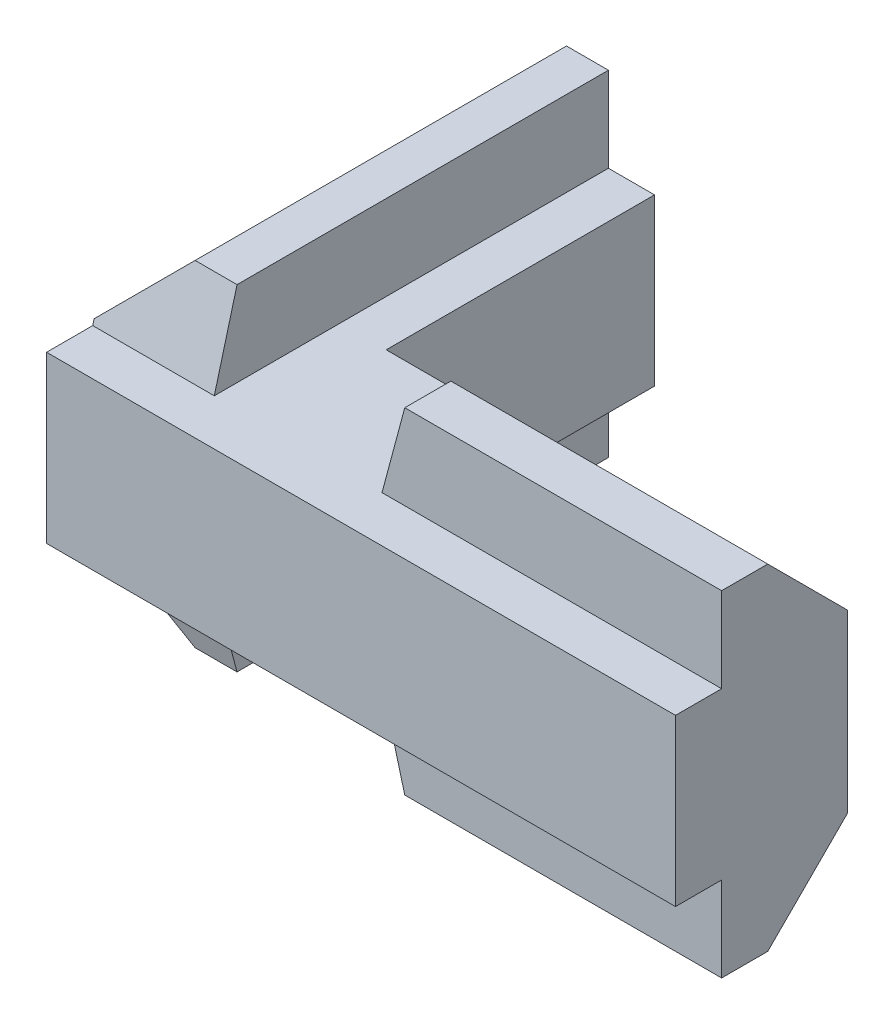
ISO-10303-21;
HEADER;
FILE_DESCRIPTION(('STEP AP214'),'2;1');
FILE_NAME('part.step','',(''),(''),'','','');
FILE_SCHEMA(('AUTOMOTIVE_DESIGN { 1 0 10303 214 1 1 1 1 }'));
ENDSEC;
DATA;
#1=APPLICATION_CONTEXT('core data for automotive mechanical design processes');
#2=APPLICATION_PROTOCOL_DEFINITION('international standard','automotive_design',2000,#1);
#3=PRODUCT_CONTEXT('',#1,'mechanical');
#4=PRODUCT('Part','Part','',(#3));
#5=PRODUCT_RELATED_PRODUCT_CATEGORY('part','',(#4));
#6=PRODUCT_DEFINITION_FORMATION('','',#4);
#7=PRODUCT_DEFINITION_CONTEXT('part definition',#1,'design');
#8=PRODUCT_DEFINITION('design','',#6,#7);
#9=PRODUCT_DEFINITION_SHAPE('','',#8);
#10=(LENGTH_UNIT() NAMED_UNIT(*) SI_UNIT(.MILLI.,.METRE.));
#11=(NAMED_UNIT(*) PLANE_ANGLE_UNIT() SI_UNIT($,.RADIAN.));
#12=(NAMED_UNIT(*) SI_UNIT($,.STERADIAN.) SOLID_ANGLE_UNIT());
#13=UNCERTAINTY_MEASURE_WITH_UNIT(LENGTH_MEASURE(1.E-05),#10,'distance_accuracy_value','');
#14=(GEOMETRIC_REPRESENTATION_CONTEXT(3) GLOBAL_UNCERTAINTY_ASSIGNED_CONTEXT((#13)) GLOBAL_UNIT_ASSIGNED_CONTEXT((#10,
#11,#12)) REPRESENTATION_CONTEXT('',''));
#15=CARTESIAN_POINT('',(0.,0.,0.));
#16=DIRECTION('',(0.,0.,1.));
#17=DIRECTION('',(1.,0.,0.));
#18=AXIS2_PLACEMENT_3D('',#15,#16,#17);
#19=CARTESIAN_POINT('',(-2.10000000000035,7.99999999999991,-21.8857402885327));
#20=DIRECTION('',(0.,1.,0.));
#21=DIRECTION('',(-1.,0.,0.));
#22=AXIS2_PLACEMENT_3D('',#19,#20,#21);
#23=PLANE('',#22);
#24=DIRECTION('',(0.,0.,1.));
#25=VECTOR('',#24,1.);
#26=CARTESIAN_POINT('',(-4.20000000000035,7.99999999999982,-1.3303366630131));
#27=LINE('',#26,#25);
#28=CARTESIAN_POINT('',(-4.20000000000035,7.99999999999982,-21.));
#29=VERTEX_POINT('',#28);
#30=CARTESIAN_POINT('',(-4.20000000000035,7.99999999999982,-3.285194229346));
#31=VERTEX_POINT('',#30);
#32=EDGE_CURVE('E239',#29,#31,#27,.T.);
#33=ORIENTED_EDGE('',*,*,#32,.T.);
#34=DIRECTION('',(1.,0.,0.));
#35=VECTOR('',#34,1.);
#36=CARTESIAN_POINT('',(-1.91000000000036,7.99999999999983,-3.28519422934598));
#37=LINE('',#36,#35);
#38=CARTESIAN_POINT('',(-2.20000000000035,7.99999999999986,-3.28519422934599));
#39=VERTEX_POINT('',#38);
#40=EDGE_CURVE('E203',#31,#39,#37,.T.);
#41=ORIENTED_EDGE('',*,*,#40,.T.);
#42=DIRECTION('',(0.,0.,1.));
#43=VECTOR('',#42,1.);
#44=CARTESIAN_POINT('',(-2.20000000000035,7.9999999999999,-1.26));
#45=LINE('',#44,#43);
#46=CARTESIAN_POINT('',(-2.20000000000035,7.99999999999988,-21.));
#47=VERTEX_POINT('',#46);
#48=EDGE_CURVE('E210',#39,#47,#45,.F.);
#49=ORIENTED_EDGE('',*,*,#48,.T.);
#50=DIRECTION('',(-1.,0.,0.));
#51=VECTOR('',#50,1.);
#52=CARTESIAN_POINT('',(0.400000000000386,7.99999999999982,-21.));
#53=LINE('',#52,#51);
#54=EDGE_CURVE('E245',#29,#47,#53,.F.);
#55=ORIENTED_EDGE('',*,*,#54,.F.);
#56=EDGE_LOOP('',(#33,#41,#49,#55));
#57=FACE_BOUND('',#56,.T.);
#58=ADVANCED_FACE('F16',(#57),#23,.T.);
#59=CARTESIAN_POINT('',(-2.09999999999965,-8.00000000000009,-21.8857402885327));
#60=DIRECTION('',(0.,1.,0.));
#61=DIRECTION('',(-1.,0.,0.));
#62=AXIS2_PLACEMENT_3D('',#59,#60,#61);
#63=PLANE('',#62);
#64=DIRECTION('',(0.,0.,1.));
#65=VECTOR('',#64,1.);
#66=CARTESIAN_POINT('',(-2.19999999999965,-8.0000000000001,-1.26));
#67=LINE('',#66,#65);
#68=CARTESIAN_POINT('',(-2.19999999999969,-8.0000000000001,-21.));
#69=VERTEX_POINT('',#68);
#70=CARTESIAN_POINT('',(-2.19999999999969,-8.0000000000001,-3.28519422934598));
#71=VERTEX_POINT('',#70);
#72=EDGE_CURVE('E19',#69,#71,#67,.T.);
#73=ORIENTED_EDGE('',*,*,#72,.T.);
#74=DIRECTION('',(1.,0.,0.));
#75=VECTOR('',#74,1.);
#76=CARTESIAN_POINT('',(-1.90999999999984,-8.00000000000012,-3.28519422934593));
#77=LINE('',#76,#75);
#78=CARTESIAN_POINT('',(-4.19999999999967,-8.00000000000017,-3.28519422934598));
#79=VERTEX_POINT('',#78);
#80=EDGE_CURVE('E170',#71,#79,#77,.F.);
#81=ORIENTED_EDGE('',*,*,#80,.T.);
#82=DIRECTION('',(0.,0.,1.));
#83=VECTOR('',#82,1.);
#84=CARTESIAN_POINT('',(-4.19999999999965,-8.00000000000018,-1.3303366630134));
#85=LINE('',#84,#83);
#86=CARTESIAN_POINT('',(-4.19999999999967,-8.00000000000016,-21.));
#87=VERTEX_POINT('',#86);
#88=EDGE_CURVE('E257',#79,#87,#85,.F.);
#89=ORIENTED_EDGE('',*,*,#88,.T.);
#90=DIRECTION('',(-1.,0.,0.));
#91=VECTOR('',#90,1.);
#92=CARTESIAN_POINT('',(0.400000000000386,-8.0000000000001,-21.));
#93=LINE('',#92,#91);
#94=EDGE_CURVE('E173',#69,#87,#93,.T.);
#95=ORIENTED_EDGE('',*,*,#94,.F.);
#96=EDGE_LOOP('',(#73,#81,#89,#95));
#97=FACE_BOUND('',#96,.T.);
#98=ADVANCED_FACE('F168',(#97),#63,.F.);
#99=CARTESIAN_POINT('',(-2.19999999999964,-8.20250000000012,-1.26));
#100=DIRECTION('',(-1.,0.,0.));
#101=DIRECTION('',(0.,-1.,0.));
#102=AXIS2_PLACEMENT_3D('',#99,#100,#101);
#103=PLANE('',#102);
#104=DIRECTION('',(0.,0.,1.));
#105=VECTOR('',#104,1.);
#106=CARTESIAN_POINT('',(-2.19999999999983,-3.9500000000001,-22.05));
#107=LINE('',#106,#105);
#108=CARTESIAN_POINT('',(-2.19999999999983,-3.95000000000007,-21.));
#109=VERTEX_POINT('',#108);
#110=CARTESIAN_POINT('',(-2.19999999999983,-3.95000000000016,-2.20000000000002));
#111=VERTEX_POINT('',#110);
#112=EDGE_CURVE('E180',#109,#111,#107,.T.);
#113=ORIENTED_EDGE('',*,*,#112,.T.);
#114=DIRECTION('',(0.,0.965925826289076,0.258819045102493));
#115=VECTOR('',#114,1.);
#116=CARTESIAN_POINT('',(-2.19999999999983,-3.74750000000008,-2.1457402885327));
#117=LINE('',#116,#115);
#118=EDGE_CURVE('E177',#111,#71,#117,.F.);
#119=ORIENTED_EDGE('',*,*,#118,.T.);
#120=ORIENTED_EDGE('',*,*,#72,.F.);
#121=DIRECTION('',(0.,1.,0.));
#122=VECTOR('',#121,1.);
#123=CARTESIAN_POINT('',(-2.19999999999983,-8.79999999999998,-21.));
#124=LINE('',#123,#122);
#125=EDGE_CURVE('E254',#109,#69,#124,.F.);
#126=ORIENTED_EDGE('',*,*,#125,.F.);
#127=EDGE_LOOP('',(#113,#119,#120,#126));
#128=FACE_BOUND('',#127,.T.);
#129=ADVANCED_FACE('F178',(#128),#103,.F.);
#130=CARTESIAN_POINT('',(-1.90999999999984,-3.74750000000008,-2.1457402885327));
#131=DIRECTION('',(0.,0.258819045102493,-0.965925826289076));
#132=DIRECTION('',(0.,0.965925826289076,0.258819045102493));
#133=AXIS2_PLACEMENT_3D('',#130,#131,#132);
#134=PLANE('',#133);
#135=DIRECTION('',(-1.,0.,0.));
#136=VECTOR('',#135,1.);
#137=CARTESIAN_POINT('',(-9.49999999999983,-3.95000000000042,-2.2));
#138=LINE('',#137,#136);
#139=CARTESIAN_POINT('',(-7.99999999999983,-3.95000000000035,-2.2));
#140=VERTEX_POINT('',#139);
#141=EDGE_CURVE('E263',#111,#140,#138,.T.);
#142=ORIENTED_EDGE('',*,*,#141,.T.);
#143=DIRECTION('',(0.,0.965925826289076,0.258819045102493));
#144=VECTOR('',#143,1.);
#145=CARTESIAN_POINT('',(-7.99999999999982,-3.7475000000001,-2.14574028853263));
#146=LINE('',#145,#144);
#147=CARTESIAN_POINT('',(-7.99999999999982,-4.20000000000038,-2.26698729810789));
#148=VERTEX_POINT('',#147);
#149=EDGE_CURVE('E185',#148,#140,#146,.T.);
#150=ORIENTED_EDGE('',*,*,#149,.F.);
#151=DIRECTION('',(0.694746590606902,-0.694746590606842,-0.186156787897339));
#152=VECTOR('',#151,1.);
#153=CARTESIAN_POINT('',(-7.99999999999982,-4.20000000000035,-2.266987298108));
#154=LINE('',#153,#152);
#155=EDGE_CURVE('E189',#148,#79,#154,.T.);
#156=ORIENTED_EDGE('',*,*,#155,.T.);
#157=ORIENTED_EDGE('',*,*,#80,.F.);
#158=ORIENTED_EDGE('',*,*,#118,.F.);
#159=EDGE_LOOP('',(#142,#150,#156,#157,#158));
#160=FACE_BOUND('',#159,.T.);
#161=ADVANCED_FACE('F187',(#160),#134,.F.);
#162=CARTESIAN_POINT('',(5.74574028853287,-3.74749999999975,-1.9));
#163=DIRECTION('',(0.965925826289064,0.258819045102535,0.));
#164=DIRECTION('',(-0.258819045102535,0.965925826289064,0.));
#165=AXIS2_PLACEMENT_3D('',#162,#163,#164);
#166=PLANE('',#165);
#167=DIRECTION('',(0.,0.,1.));
#168=VECTOR('',#167,1.);
#169=CARTESIAN_POINT('',(5.80000000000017,-3.94999999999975,-22.05));
#170=LINE('',#169,#168);
#171=CARTESIAN_POINT('',(5.80000000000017,-3.94999999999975,-2.2));
#172=VERTEX_POINT('',#171);
#173=CARTESIAN_POINT('',(5.80000000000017,-3.94999999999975,-8.2));
#174=VERTEX_POINT('',#173);
#175=EDGE_CURVE('E268',#172,#174,#170,.F.);
#176=ORIENTED_EDGE('',*,*,#175,.T.);
#177=DIRECTION('',(-0.2588190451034,0.965925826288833,0.));
#178=VECTOR('',#177,1.);
#179=CARTESIAN_POINT('',(5.86698729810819,-4.19999999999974,-8.2));
#180=LINE('',#179,#178);
#181=CARTESIAN_POINT('',(5.86698729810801,-4.19999999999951,-8.20000000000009));
#182=VERTEX_POINT('',#181);
#183=EDGE_CURVE('E212',#182,#174,#180,.T.);
#184=ORIENTED_EDGE('',*,*,#183,.F.);
#185=DIRECTION('',(0.186156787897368,-0.694746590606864,0.694746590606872));
#186=VECTOR('',#185,1.);
#187=CARTESIAN_POINT('',(5.86698729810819,-4.19999999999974,-8.2));
#188=LINE('',#187,#186);
#189=CARTESIAN_POINT('',(6.88519422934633,-7.9999999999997,-4.4));
#190=VERTEX_POINT('',#189);
#191=EDGE_CURVE('E199',#182,#190,#188,.T.);
#192=ORIENTED_EDGE('',*,*,#191,.T.);
#193=DIRECTION('',(0.,0.,1.));
#194=VECTOR('',#193,1.);
#195=CARTESIAN_POINT('',(6.88519422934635,-7.99999999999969,-4.51));
#196=LINE('',#195,#194);
#197=CARTESIAN_POINT('',(6.88519422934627,-7.99999999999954,-2.2));
#198=VERTEX_POINT('',#197);
#199=EDGE_CURVE('E162',#190,#198,#196,.T.);
#200=ORIENTED_EDGE('',*,*,#199,.T.);
#201=DIRECTION('',(-0.258819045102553,0.965925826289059,0.));
#202=VECTOR('',#201,1.);
#203=CARTESIAN_POINT('',(6.88519422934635,-7.9999999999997,-2.2));
#204=LINE('',#203,#202);
#205=EDGE_CURVE('E184',#198,#172,#204,.T.);
#206=ORIENTED_EDGE('',*,*,#205,.T.);
#207=EDGE_LOOP('',(#176,#184,#192,#200,#206));
#208=FACE_BOUND('',#207,.T.);
#209=ADVANCED_FACE('F564',(#208),#166,.F.);
#210=CARTESIAN_POINT('',(4.99000000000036,-8.2024999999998,-2.2));
#211=DIRECTION('',(0.,0.,-1.));
#212=DIRECTION('',(-1.,0.,0.));
#213=AXIS2_PLACEMENT_3D('',#210,#211,#212);
#214=PLANE('',#213);
#215=DIRECTION('',(0.,1.,0.));
#216=VECTOR('',#215,1.);
#217=CARTESIAN_POINT('',(22.0000000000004,-8.79999999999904,-2.2));
#218=LINE('',#217,#216);
#219=CARTESIAN_POINT('',(22.0000000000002,-3.9499999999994,-2.2));
#220=VERTEX_POINT('',#219);
#221=CARTESIAN_POINT('',(22.0000000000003,-7.99999999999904,-2.2));
#222=VERTEX_POINT('',#221);
#223=EDGE_CURVE('E278',#220,#222,#218,.F.);
#224=ORIENTED_EDGE('',*,*,#223,.F.);
#225=DIRECTION('',(-1.,0.,0.));
#226=VECTOR('',#225,1.);
#227=CARTESIAN_POINT('',(-9.49999999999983,-3.95000000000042,-2.2));
#228=LINE('',#227,#226);
#229=EDGE_CURVE('E265',#220,#172,#228,.T.);
#230=ORIENTED_EDGE('',*,*,#229,.T.);
#231=ORIENTED_EDGE('',*,*,#205,.F.);
#232=DIRECTION('',(-1.,0.,0.));
#233=VECTOR('',#232,1.);
#234=CARTESIAN_POINT('',(22.755740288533,-7.999999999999,-2.2));
#235=LINE('',#234,#233);
#236=EDGE_CURVE('E195',#198,#222,#235,.F.);
#237=ORIENTED_EDGE('',*,*,#236,.T.);
#238=EDGE_LOOP('',(#224,#230,#231,#237));
#239=FACE_BOUND('',#238,.T.);
#240=ADVANCED_FACE('F391',(#239),#214,.F.);
#241=CARTESIAN_POINT('',(22.755740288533,-7.999999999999,-4.51));
#242=DIRECTION('',(0.,1.,0.));
#243=DIRECTION('',(-1.,0.,0.));
#244=AXIS2_PLACEMENT_3D('',#241,#242,#243);
#245=PLANE('',#244);
#246=ORIENTED_EDGE('',*,*,#236,.F.);
#247=ORIENTED_EDGE('',*,*,#199,.F.);
#248=DIRECTION('',(1.,0.,0.));
#249=VECTOR('',#248,1.);
#250=CARTESIAN_POINT('',(5.06033666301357,-7.99999999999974,-4.40000000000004));
#251=LINE('',#250,#249);
#252=CARTESIAN_POINT('',(22.0000000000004,-7.99999999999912,-4.39999999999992));
#253=VERTEX_POINT('',#252);
#254=EDGE_CURVE('E197',#190,#253,#251,.T.);
#255=ORIENTED_EDGE('',*,*,#254,.T.);
#256=DIRECTION('',(0.,0.,1.));
#257=VECTOR('',#256,1.);
#258=CARTESIAN_POINT('',(22.0000000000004,-7.99999999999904,0.410000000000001));
#259=LINE('',#258,#257);
#260=EDGE_CURVE('E281',#222,#253,#259,.F.);
#261=ORIENTED_EDGE('',*,*,#260,.F.);
#262=EDGE_LOOP('',(#246,#247,#255,#261));
#263=FACE_BOUND('',#262,.T.);
#264=ADVANCED_FACE('F394',(#263),#245,.F.);
#265=CARTESIAN_POINT('',(5.06033666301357,-4.00999999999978,-8.39));
#266=DIRECTION('',(0.,0.707106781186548,0.707106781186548));
#267=DIRECTION('',(0.,-0.707106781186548,0.707106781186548));
#268=AXIS2_PLACEMENT_3D('',#265,#266,#267);
#269=PLANE('',#268);
#270=DIRECTION('',(-1.,0.,0.));
#271=VECTOR('',#270,1.);
#272=CARTESIAN_POINT('',(23.1000000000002,-4.19999999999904,-8.2));
#273=LINE('',#272,#271);
#274=CARTESIAN_POINT('',(22.0000000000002,-4.19999999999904,-8.2));
#275=VERTEX_POINT('',#274);
#276=EDGE_CURVE('E220',#275,#182,#273,.T.);
#277=ORIENTED_EDGE('',*,*,#276,.F.);
#278=DIRECTION('',(0.,0.707106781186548,-0.707106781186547));
#279=VECTOR('',#278,1.);
#280=CARTESIAN_POINT('',(22.0000000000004,-7.99999999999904,-4.4));
#281=LINE('',#280,#279);
#282=EDGE_CURVE('E284',#253,#275,#281,.T.);
#283=ORIENTED_EDGE('',*,*,#282,.F.);
#284=ORIENTED_EDGE('',*,*,#254,.F.);
#285=ORIENTED_EDGE('',*,*,#191,.F.);
#286=EDGE_LOOP('',(#277,#283,#284,#285));
#287=FACE_BOUND('',#286,.T.);
#288=ADVANCED_FACE('F399',(#287),#269,.F.);
#289=CARTESIAN_POINT('',(5.06033666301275,8.19000000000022,-4.21));
#290=DIRECTION('',(0.,-0.707106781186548,0.707106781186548));
#291=DIRECTION('',(0.,-0.707106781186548,-0.707106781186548));
#292=AXIS2_PLACEMENT_3D('',#289,#290,#291);
#293=PLANE('',#292);
#294=DIRECTION('',(-1.,0.,0.));
#295=VECTOR('',#294,1.);
#296=CARTESIAN_POINT('',(23.1000000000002,4.20000000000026,-8.2));
#297=LINE('',#296,#295);
#298=CARTESIAN_POINT('',(5.86698729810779,4.20000000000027,-8.2));
#299=VERTEX_POINT('',#298);
#300=CARTESIAN_POINT('',(21.9999999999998,4.20000000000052,-8.20000000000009));
#301=VERTEX_POINT('',#300);
#302=EDGE_CURVE('E218',#299,#301,#297,.F.);
#303=ORIENTED_EDGE('',*,*,#302,.F.);
#304=DIRECTION('',(0.186156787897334,0.694746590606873,0.694746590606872));
#305=VECTOR('',#304,1.);
#306=CARTESIAN_POINT('',(5.86698729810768,4.2000000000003,-8.2));
#307=LINE('',#306,#305);
#308=CARTESIAN_POINT('',(6.88519422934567,8.00000000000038,-4.39999999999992));
#309=VERTEX_POINT('',#308);
#310=EDGE_CURVE('E228',#299,#309,#307,.T.);
#311=ORIENTED_EDGE('',*,*,#310,.T.);
#312=DIRECTION('',(-1.,0.,0.));
#313=VECTOR('',#312,1.);
#314=CARTESIAN_POINT('',(22.7557402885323,8.00000000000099,-4.4));
#315=LINE('',#314,#313);
#316=CARTESIAN_POINT('',(21.9999999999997,8.00000000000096,-4.4));
#317=VERTEX_POINT('',#316);
#318=EDGE_CURVE('E201',#317,#309,#315,.T.);
#319=ORIENTED_EDGE('',*,*,#318,.F.);
#320=DIRECTION('',(0.,0.707106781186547,0.707106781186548));
#321=VECTOR('',#320,1.);
#322=CARTESIAN_POINT('',(21.9999999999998,4.20000000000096,-8.2));
#323=LINE('',#322,#321);
#324=EDGE_CURVE('E290',#301,#317,#323,.T.);
#325=ORIENTED_EDGE('',*,*,#324,.F.);
#326=EDGE_LOOP('',(#303,#311,#319,#325));
#327=FACE_BOUND('',#326,.T.);
#328=ADVANCED_FACE('F402',(#327),#293,.F.);
#329=CARTESIAN_POINT('',(22.7557402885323,8.00000000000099,-4.51));
#330=DIRECTION('',(0.,1.,0.));
#331=DIRECTION('',(-1.,0.,0.));
#332=AXIS2_PLACEMENT_3D('',#329,#330,#331);
#333=PLANE('',#332);
#334=DIRECTION('',(0.,0.,1.));
#335=VECTOR('',#334,1.);
#336=CARTESIAN_POINT('',(21.9999999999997,8.00000000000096,0.410000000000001));
#337=LINE('',#336,#335);
#338=CARTESIAN_POINT('',(21.9999999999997,8.00000000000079,-2.2));
#339=VERTEX_POINT('',#338);
#340=EDGE_CURVE('E293',#317,#339,#337,.T.);
#341=ORIENTED_EDGE('',*,*,#340,.F.);
#342=ORIENTED_EDGE('',*,*,#318,.T.);
#343=DIRECTION('',(0.,0.,1.));
#344=VECTOR('',#343,1.);
#345=CARTESIAN_POINT('',(6.88519422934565,8.0000000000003,-1.9));
#346=LINE('',#345,#344);
#347=CARTESIAN_POINT('',(6.88519422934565,8.0000000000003,-2.2));
#348=VERTEX_POINT('',#347);
#349=EDGE_CURVE('E223',#309,#348,#346,.T.);
#350=ORIENTED_EDGE('',*,*,#349,.T.);
#351=DIRECTION('',(-1.,0.,0.));
#352=VECTOR('',#351,1.);
#353=CARTESIAN_POINT('',(4.98999999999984,8.0000000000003,-2.2));
#354=LINE('',#353,#352);
#355=EDGE_CURVE('E234',#348,#339,#354,.F.);
#356=ORIENTED_EDGE('',*,*,#355,.T.);
#357=EDGE_LOOP('',(#341,#342,#350,#356));
#358=FACE_BOUND('',#357,.T.);
#359=ADVANCED_FACE('F404',(#358),#333,.T.);
#360=CARTESIAN_POINT('',(-1.91000000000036,8.20249999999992,-3.3394539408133));
#361=DIRECTION('',(0.,-0.258819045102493,-0.965925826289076));
#362=DIRECTION('',(0.,0.965925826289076,-0.258819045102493));
#363=AXIS2_PLACEMENT_3D('',#360,#361,#362);
#364=PLANE('',#363);
#365=DIRECTION('',(0.,0.965925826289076,-0.258819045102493));
#366=VECTOR('',#365,1.);
#367=CARTESIAN_POINT('',(-8.00000000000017,8.2024999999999,-3.33945394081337));
#368=LINE('',#367,#366);
#369=CARTESIAN_POINT('',(-8.00000000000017,3.94999999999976,-2.20000000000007));
#370=VERTEX_POINT('',#369);
#371=CARTESIAN_POINT('',(-8.00000000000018,4.19999999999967,-2.26698729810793));
#372=VERTEX_POINT('',#371);
#373=EDGE_CURVE('E205',#370,#372,#368,.T.);
#374=ORIENTED_EDGE('',*,*,#373,.F.);
#375=DIRECTION('',(1.,0.,0.));
#376=VECTOR('',#375,1.);
#377=CARTESIAN_POINT('',(-9.50000000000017,3.94999999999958,-2.2));
#378=LINE('',#377,#376);
#379=CARTESIAN_POINT('',(-2.20000000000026,3.94999999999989,-2.20000000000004));
#380=VERTEX_POINT('',#379);
#381=EDGE_CURVE('E302',#370,#380,#378,.T.);
#382=ORIENTED_EDGE('',*,*,#381,.T.);
#383=DIRECTION('',(0.,0.965925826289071,-0.25881904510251));
#384=VECTOR('',#383,1.);
#385=CARTESIAN_POINT('',(-2.20000000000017,3.9499999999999,-2.2));
#386=LINE('',#385,#384);
#387=EDGE_CURVE('E207',#380,#39,#386,.T.);
#388=ORIENTED_EDGE('',*,*,#387,.T.);
#389=ORIENTED_EDGE('',*,*,#40,.F.);
#390=DIRECTION('',(-0.694746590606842,-0.694746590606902,0.186156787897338));
#391=VECTOR('',#390,1.);
#392=CARTESIAN_POINT('',(-4.20000000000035,7.99999999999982,-3.285194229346));
#393=LINE('',#392,#391);
#394=EDGE_CURVE('E236',#31,#372,#393,.T.);
#395=ORIENTED_EDGE('',*,*,#394,.T.);
#396=EDGE_LOOP('',(#374,#382,#388,#389,#395));
#397=FACE_BOUND('',#396,.T.);
#398=ADVANCED_FACE('F379',(#397),#364,.F.);
#399=CARTESIAN_POINT('',(-2.20000000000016,3.74749999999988,-1.26));
#400=DIRECTION('',(-1.,0.,0.));
#401=DIRECTION('',(0.,-1.,0.));
#402=AXIS2_PLACEMENT_3D('',#399,#400,#401);
#403=PLANE('',#402);
#404=DIRECTION('',(0.,1.,0.));
#405=VECTOR('',#404,1.);
#406=CARTESIAN_POINT('',(-2.20000000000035,-8.79999999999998,-21.));
#407=LINE('',#406,#405);
#408=CARTESIAN_POINT('',(-2.20000000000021,3.9499999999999,-21.));
#409=VERTEX_POINT('',#408);
#410=EDGE_CURVE('E248',#47,#409,#407,.F.);
#411=ORIENTED_EDGE('',*,*,#410,.F.);
#412=ORIENTED_EDGE('',*,*,#48,.F.);
#413=ORIENTED_EDGE('',*,*,#387,.F.);
#414=DIRECTION('',(0.,0.,1.));
#415=VECTOR('',#414,1.);
#416=CARTESIAN_POINT('',(-2.20000000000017,3.9499999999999,1.05));
#417=LINE('',#416,#415);
#418=EDGE_CURVE('E304',#380,#409,#417,.F.);
#419=ORIENTED_EDGE('',*,*,#418,.T.);
#420=EDGE_LOOP('',(#411,#412,#413,#419));
#421=FACE_BOUND('',#420,.T.);
#422=ADVANCED_FACE('F376',(#421),#403,.F.);
#423=CARTESIAN_POINT('',(1.905253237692E-13,-4.345,-7.56));
#424=DIRECTION('',(1.,0.,0.));
#425=DIRECTION('',(0.,1.,0.));
#426=AXIS2_PLACEMENT_3D('',#423,#424,#425);
#427=PLANE('',#426);
#428=DIRECTION('',(0.,0.,1.));
#429=VECTOR('',#428,1.);
#430=CARTESIAN_POINT('',(1.73472347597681E-13,-3.95,-22.05));
#431=LINE('',#430,#429);
#432=CARTESIAN_POINT('',(1.73425787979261E-13,-3.94999999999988,-8.2));
#433=VERTEX_POINT('',#432);
#434=CARTESIAN_POINT('',(0.,-3.95,-21.));
#435=VERTEX_POINT('',#434);
#436=EDGE_CURVE('E273',#433,#435,#431,.F.);
#437=ORIENTED_EDGE('',*,*,#436,.T.);
#438=DIRECTION('',(0.,1.,0.));
#439=VECTOR('',#438,1.);
#440=CARTESIAN_POINT('',(-1.71520783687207E-13,-8.79999999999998,-21.));
#441=LINE('',#440,#439);
#442=CARTESIAN_POINT('',(-1.71569343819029E-13,3.94999999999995,-21.));
#443=VERTEX_POINT('',#442);
#444=EDGE_CURVE('E251',#443,#435,#441,.F.);
#445=ORIENTED_EDGE('',*,*,#444,.F.);
#446=DIRECTION('',(0.,0.,1.));
#447=VECTOR('',#446,1.);
#448=CARTESIAN_POINT('',(-1.71737624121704E-13,3.95,1.05));
#449=LINE('',#448,#447);
#450=CARTESIAN_POINT('',(0.,3.95,-8.2));
#451=VERTEX_POINT('',#450);
#452=EDGE_CURVE('E309',#443,#451,#449,.T.);
#453=ORIENTED_EDGE('',*,*,#452,.T.);
#454=DIRECTION('',(0.,1.,0.));
#455=VECTOR('',#454,1.);
#456=CARTESIAN_POINT('',(1.73472347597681E-13,-4.61999999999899,-8.2));
#457=LINE('',#456,#455);
#458=EDGE_CURVE('E215',#433,#451,#457,.T.);
#459=ORIENTED_EDGE('',*,*,#458,.F.);
#460=EDGE_LOOP('',(#437,#445,#453,#459));
#461=FACE_BOUND('',#460,.T.);
#462=ADVANCED_FACE('F368',(#461),#427,.T.);
#463=CARTESIAN_POINT('',(23.1000000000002,-4.61999999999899,-8.2));
#464=DIRECTION('',(0.,0.,-1.));
#465=DIRECTION('',(-1.,0.,0.));
#466=AXIS2_PLACEMENT_3D('',#463,#464,#465);
#467=PLANE('',#466);
#468=DIRECTION('',(0.,1.,0.));
#469=VECTOR('',#468,1.);
#470=CARTESIAN_POINT('',(22.0000000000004,-8.79999999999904,-8.2));
#471=LINE('',#470,#469);
#472=EDGE_CURVE('E287',#275,#301,#471,.T.);
#473=ORIENTED_EDGE('',*,*,#472,.F.);
#474=ORIENTED_EDGE('',*,*,#276,.T.);
#475=ORIENTED_EDGE('',*,*,#183,.T.);
#476=DIRECTION('',(-1.,0.,0.));
#477=VECTOR('',#476,1.);
#478=CARTESIAN_POINT('',(-9.49999999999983,-3.95000000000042,-8.2));
#479=LINE('',#478,#477);
#480=EDGE_CURVE('E270',#174,#433,#479,.T.);
#481=ORIENTED_EDGE('',*,*,#480,.T.);
#482=ORIENTED_EDGE('',*,*,#458,.T.);
#483=DIRECTION('',(1.,0.,0.));
#484=VECTOR('',#483,1.);
#485=CARTESIAN_POINT('',(-9.50000000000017,3.94999999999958,-8.2));
#486=LINE('',#485,#484);
#487=CARTESIAN_POINT('',(5.79999999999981,3.95000000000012,-8.2));
#488=VERTEX_POINT('',#487);
#489=EDGE_CURVE('E311',#451,#488,#486,.T.);
#490=ORIENTED_EDGE('',*,*,#489,.T.);
#491=DIRECTION('',(0.258819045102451,0.965925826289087,0.));
#492=VECTOR('',#491,1.);
#493=CARTESIAN_POINT('',(6.93945394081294,8.2025000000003,-8.2));
#494=LINE('',#493,#492);
#495=EDGE_CURVE('E225',#488,#299,#494,.T.);
#496=ORIENTED_EDGE('',*,*,#495,.T.);
#497=ORIENTED_EDGE('',*,*,#302,.T.);
#498=EDGE_LOOP('',(#473,#474,#475,#481,#482,#490,#496,#497));
#499=FACE_BOUND('',#498,.T.);
#500=ADVANCED_FACE('F364',(#499),#467,.T.);
#501=CARTESIAN_POINT('',(6.93945394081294,8.2025000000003,-1.9));
#502=DIRECTION('',(0.965925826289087,-0.258819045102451,0.));
#503=DIRECTION('',(0.258819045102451,0.965925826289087,0.));
#504=AXIS2_PLACEMENT_3D('',#501,#502,#503);
#505=PLANE('',#504);
#506=ORIENTED_EDGE('',*,*,#495,.F.);
#507=DIRECTION('',(0.,0.,1.));
#508=VECTOR('',#507,1.);
#509=CARTESIAN_POINT('',(5.79999999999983,3.95000000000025,1.05));
#510=LINE('',#509,#508);
#511=CARTESIAN_POINT('',(5.79999999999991,3.95000000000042,-2.2));
#512=VERTEX_POINT('',#511);
#513=EDGE_CURVE('E313',#488,#512,#510,.T.);
#514=ORIENTED_EDGE('',*,*,#513,.T.);
#515=DIRECTION('',(0.258819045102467,0.965925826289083,0.));
#516=VECTOR('',#515,1.);
#517=CARTESIAN_POINT('',(5.79999999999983,3.95000000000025,-2.2));
#518=LINE('',#517,#516);
#519=EDGE_CURVE('E231',#512,#348,#518,.T.);
#520=ORIENTED_EDGE('',*,*,#519,.T.);
#521=ORIENTED_EDGE('',*,*,#349,.F.);
#522=ORIENTED_EDGE('',*,*,#310,.F.);
#523=EDGE_LOOP('',(#506,#514,#520,#521,#522));
#524=FACE_BOUND('',#523,.T.);
#525=ADVANCED_FACE('F357',(#524),#505,.F.);
#526=CARTESIAN_POINT('',(4.98999999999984,3.7475000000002,-2.2));
#527=DIRECTION('',(0.,0.,-1.));
#528=DIRECTION('',(-1.,0.,0.));
#529=AXIS2_PLACEMENT_3D('',#526,#527,#528);
#530=PLANE('',#529);
#531=DIRECTION('',(0.,1.,0.));
#532=VECTOR('',#531,1.);
#533=CARTESIAN_POINT('',(22.0000000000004,-8.79999999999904,-2.2));
#534=LINE('',#533,#532);
#535=CARTESIAN_POINT('',(21.9999999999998,3.95000000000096,-2.2));
#536=VERTEX_POINT('',#535);
#537=EDGE_CURVE('E296',#339,#536,#534,.F.);
#538=ORIENTED_EDGE('',*,*,#537,.F.);
#539=ORIENTED_EDGE('',*,*,#355,.F.);
#540=ORIENTED_EDGE('',*,*,#519,.F.);
#541=DIRECTION('',(1.,0.,0.));
#542=VECTOR('',#541,1.);
#543=CARTESIAN_POINT('',(-9.50000000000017,3.94999999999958,-2.2));
#544=LINE('',#543,#542);
#545=EDGE_CURVE('E315',#512,#536,#544,.T.);
#546=ORIENTED_EDGE('',*,*,#545,.T.);
#547=EDGE_LOOP('',(#538,#539,#540,#546));
#548=FACE_BOUND('',#547,.T.);
#549=ADVANCED_FACE('F352',(#548),#530,.F.);
#550=CARTESIAN_POINT('',(-4.01000000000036,8.18999999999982,-1.3303366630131));
#551=DIRECTION('',(0.707106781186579,-0.707106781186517,0.));
#552=DIRECTION('',(0.707106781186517,0.707106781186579,0.));
#553=AXIS2_PLACEMENT_3D('',#550,#551,#552);
#554=PLANE('',#553);
#555=DIRECTION('',(0.707106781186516,0.707106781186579,0.));
#556=VECTOR('',#555,1.);
#557=CARTESIAN_POINT('',(-8.00000000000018,4.19999999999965,-21.));
#558=LINE('',#557,#556);
#559=CARTESIAN_POINT('',(-8.00000000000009,4.19999999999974,-21.));
#560=VERTEX_POINT('',#559);
#561=EDGE_CURVE('E242',#560,#29,#558,.T.);
#562=ORIENTED_EDGE('',*,*,#561,.F.);
#563=DIRECTION('',(0.,0.,1.));
#564=VECTOR('',#563,1.);
#565=CARTESIAN_POINT('',(-8.00000000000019,4.19999999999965,-22.05));
#566=LINE('',#565,#564);
#567=EDGE_CURVE('E323',#372,#560,#566,.F.);
#568=ORIENTED_EDGE('',*,*,#567,.F.);
#569=ORIENTED_EDGE('',*,*,#394,.F.);
#570=ORIENTED_EDGE('',*,*,#32,.F.);
#571=EDGE_LOOP('',(#562,#568,#569,#570));
#572=FACE_BOUND('',#571,.T.);
#573=ADVANCED_FACE('F433',(#572),#554,.F.);
#574=CARTESIAN_POINT('',(0.400000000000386,-8.79999999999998,-21.));
#575=DIRECTION('',(0.,0.,-1.));
#576=DIRECTION('',(-1.,0.,0.));
#577=AXIS2_PLACEMENT_3D('',#574,#575,#576);
#578=PLANE('',#577);
#579=ORIENTED_EDGE('',*,*,#94,.T.);
#580=DIRECTION('',(-0.707106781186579,0.707106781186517,0.));
#581=VECTOR('',#580,1.);
#582=CARTESIAN_POINT('',(-8.18999999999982,-4.01000000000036,-21.));
#583=LINE('',#582,#581);
#584=CARTESIAN_POINT('',(-7.99999999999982,-4.20000000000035,-21.));
#585=VERTEX_POINT('',#584);
#586=EDGE_CURVE('E259',#87,#585,#583,.T.);
#587=ORIENTED_EDGE('',*,*,#586,.T.);
#588=DIRECTION('',(0.,-1.,0.));
#589=VECTOR('',#588,1.);
#590=CARTESIAN_POINT('',(-7.9999999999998,-4.62000000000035,-21.));
#591=LINE('',#590,#589);
#592=EDGE_CURVE('E326',#560,#585,#591,.T.);
#593=ORIENTED_EDGE('',*,*,#592,.F.);
#594=ORIENTED_EDGE('',*,*,#561,.T.);
#595=ORIENTED_EDGE('',*,*,#54,.T.);
#596=ORIENTED_EDGE('',*,*,#410,.T.);
#597=DIRECTION('',(1.,0.,0.));
#598=VECTOR('',#597,1.);
#599=CARTESIAN_POINT('',(-9.50000000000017,3.94999999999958,-21.));
#600=LINE('',#599,#598);
#601=EDGE_CURVE('E306',#409,#443,#600,.T.);
#602=ORIENTED_EDGE('',*,*,#601,.T.);
#603=ORIENTED_EDGE('',*,*,#444,.T.);
#604=DIRECTION('',(-1.,0.,0.));
#605=VECTOR('',#604,1.);
#606=CARTESIAN_POINT('',(-9.49999999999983,-3.95000000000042,-21.));
#607=LINE('',#606,#605);
#608=EDGE_CURVE('E275',#435,#109,#607,.T.);
#609=ORIENTED_EDGE('',*,*,#608,.T.);
#610=ORIENTED_EDGE('',*,*,#125,.T.);
#611=EDGE_LOOP('',(#579,#587,#593,#594,#595,#596,#602,#603,#609,#610));
#612=FACE_BOUND('',#611,.T.);
#613=ADVANCED_FACE('F371',(#612),#578,.T.);
#614=CARTESIAN_POINT('',(-8.18999999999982,-4.01000000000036,-1.3303366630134));
#615=DIRECTION('',(0.707106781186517,0.707106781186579,0.));
#616=DIRECTION('',(-0.707106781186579,0.707106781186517,0.));
#617=AXIS2_PLACEMENT_3D('',#614,#615,#616);
#618=PLANE('',#617);
#619=DIRECTION('',(0.,0.,1.));
#620=VECTOR('',#619,1.);
#621=CARTESIAN_POINT('',(-7.99999999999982,-4.20000000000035,-22.05));
#622=LINE('',#621,#620);
#623=EDGE_CURVE('E329',#585,#148,#622,.T.);
#624=ORIENTED_EDGE('',*,*,#623,.F.);
#625=ORIENTED_EDGE('',*,*,#586,.F.);
#626=ORIENTED_EDGE('',*,*,#88,.F.);
#627=ORIENTED_EDGE('',*,*,#155,.F.);
#628=EDGE_LOOP('',(#624,#625,#626,#627));
#629=FACE_BOUND('',#628,.T.);
#630=ADVANCED_FACE('F427',(#629),#618,.F.);
#631=CARTESIAN_POINT('',(-9.49999999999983,-3.95000000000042,-22.05));
#632=DIRECTION('',(0.,1.,0.));
#633=DIRECTION('',(-1.,0.,0.));
#634=AXIS2_PLACEMENT_3D('',#631,#632,#633);
#635=PLANE('',#634);
#636=ORIENTED_EDGE('',*,*,#436,.F.);
#637=ORIENTED_EDGE('',*,*,#480,.F.);
#638=ORIENTED_EDGE('',*,*,#175,.F.);
#639=ORIENTED_EDGE('',*,*,#229,.F.);
#640=DIRECTION('',(0.,0.,1.));
#641=VECTOR('',#640,1.);
#642=CARTESIAN_POINT('',(22.0000000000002,-3.94999999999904,0.410000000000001));
#643=LINE('',#642,#641);
#644=CARTESIAN_POINT('',(22.0000000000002,-3.94999999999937,0.));
#645=VERTEX_POINT('',#644);
#646=EDGE_CURVE('E299',#645,#220,#643,.F.);
#647=ORIENTED_EDGE('',*,*,#646,.F.);
#648=DIRECTION('',(1.,0.,0.));
#649=VECTOR('',#648,1.);
#650=CARTESIAN_POINT('',(-9.49999999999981,-3.95000000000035,0.));
#651=LINE('',#650,#649);
#652=CARTESIAN_POINT('',(-7.99999999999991,-3.95000000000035,0.));
#653=VERTEX_POINT('',#652);
#654=EDGE_CURVE('E332',#653,#645,#651,.T.);
#655=ORIENTED_EDGE('',*,*,#654,.F.);
#656=DIRECTION('',(0.,0.,1.));
#657=VECTOR('',#656,1.);
#658=CARTESIAN_POINT('',(-7.99999999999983,-3.95000000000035,-22.05));
#659=LINE('',#658,#657);
#660=EDGE_CURVE('E319',#140,#653,#659,.T.);
#661=ORIENTED_EDGE('',*,*,#660,.F.);
#662=ORIENTED_EDGE('',*,*,#141,.F.);
#663=ORIENTED_EDGE('',*,*,#112,.F.);
#664=ORIENTED_EDGE('',*,*,#608,.F.);
#665=EDGE_LOOP('',(#636,#637,#638,#639,#647,#655,#661,#662,#663,#664));
#666=FACE_BOUND('',#665,.T.);
#667=ADVANCED_FACE('F386',(#666),#635,.F.);
#668=CARTESIAN_POINT('',(22.0000000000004,-8.79999999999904,0.410000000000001));
#669=DIRECTION('',(1.,0.,0.));
#670=DIRECTION('',(0.,1.,0.));
#671=AXIS2_PLACEMENT_3D('',#668,#669,#670);
#672=PLANE('',#671);
#673=DIRECTION('',(0.,1.,0.));
#674=VECTOR('',#673,1.);
#675=CARTESIAN_POINT('',(22.0000000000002,-4.34500000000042,0.));
#676=LINE('',#675,#674);
#677=CARTESIAN_POINT('',(21.9999999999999,3.95000000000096,0.));
#678=VERTEX_POINT('',#677);
#679=EDGE_CURVE('E335',#645,#678,#676,.T.);
#680=ORIENTED_EDGE('',*,*,#679,.F.);
#681=ORIENTED_EDGE('',*,*,#646,.T.);
#682=ORIENTED_EDGE('',*,*,#223,.T.);
#683=ORIENTED_EDGE('',*,*,#260,.T.);
#684=ORIENTED_EDGE('',*,*,#282,.T.);
#685=ORIENTED_EDGE('',*,*,#472,.T.);
#686=ORIENTED_EDGE('',*,*,#324,.T.);
#687=ORIENTED_EDGE('',*,*,#340,.T.);
#688=ORIENTED_EDGE('',*,*,#537,.T.);
#689=DIRECTION('',(0.,0.,1.));
#690=VECTOR('',#689,1.);
#691=CARTESIAN_POINT('',(21.9999999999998,3.95000000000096,1.05));
#692=LINE('',#691,#690);
#693=EDGE_CURVE('E317',#536,#678,#692,.T.);
#694=ORIENTED_EDGE('',*,*,#693,.T.);
#695=EDGE_LOOP('',(#680,#681,#682,#683,#684,#685,#686,#687,#688,#694));
#696=FACE_BOUND('',#695,.T.);
#697=ADVANCED_FACE('F347',(#696),#672,.T.);
#698=CARTESIAN_POINT('',(-9.50000000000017,3.94999999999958,1.05));
#699=DIRECTION('',(0.,-1.,0.));
#700=DIRECTION('',(1.,0.,0.));
#701=AXIS2_PLACEMENT_3D('',#698,#699,#700);
#702=PLANE('',#701);
#703=ORIENTED_EDGE('',*,*,#545,.F.);
#704=ORIENTED_EDGE('',*,*,#513,.F.);
#705=ORIENTED_EDGE('',*,*,#489,.F.);
#706=ORIENTED_EDGE('',*,*,#452,.F.);
#707=ORIENTED_EDGE('',*,*,#601,.F.);
#708=ORIENTED_EDGE('',*,*,#418,.F.);
#709=ORIENTED_EDGE('',*,*,#381,.F.);
#710=DIRECTION('',(0.,0.,1.));
#711=VECTOR('',#710,1.);
#712=CARTESIAN_POINT('',(-8.00000000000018,3.94999999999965,-22.05));
#713=LINE('',#712,#711);
#714=CARTESIAN_POINT('',(-8.00000000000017,3.94999999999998,0.));
#715=VERTEX_POINT('',#714);
#716=EDGE_CURVE('E34',#715,#370,#713,.F.);
#717=ORIENTED_EDGE('',*,*,#716,.F.);
#718=DIRECTION('',(1.,0.,0.));
#719=VECTOR('',#718,1.);
#720=CARTESIAN_POINT('',(-9.49999999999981,3.95000000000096,0.));
#721=LINE('',#720,#719);
#722=EDGE_CURVE('E25',#678,#715,#721,.F.);
#723=ORIENTED_EDGE('',*,*,#722,.F.);
#724=ORIENTED_EDGE('',*,*,#693,.F.);
#725=EDGE_LOOP('',(#703,#704,#705,#706,#707,#708,#709,#717,#723,#724));
#726=FACE_BOUND('',#725,.T.);
#727=ADVANCED_FACE('F344',(#726),#702,.F.);
#728=CARTESIAN_POINT('',(-7.9999999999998,-4.62000000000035,-22.05));
#729=DIRECTION('',(-1.,0.,0.));
#730=DIRECTION('',(0.,-1.,0.));
#731=AXIS2_PLACEMENT_3D('',#728,#729,#730);
#732=PLANE('',#731);
#733=ORIENTED_EDGE('',*,*,#592,.T.);
#734=ORIENTED_EDGE('',*,*,#623,.T.);
#735=ORIENTED_EDGE('',*,*,#149,.T.);
#736=ORIENTED_EDGE('',*,*,#660,.T.);
#737=DIRECTION('',(0.,1.,0.));
#738=VECTOR('',#737,1.);
#739=CARTESIAN_POINT('',(-8.00000000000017,-4.34500000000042,0.));
#740=LINE('',#739,#738);
#741=EDGE_CURVE('E10',#715,#653,#740,.F.);
#742=ORIENTED_EDGE('',*,*,#741,.F.);
#743=ORIENTED_EDGE('',*,*,#716,.T.);
#744=ORIENTED_EDGE('',*,*,#373,.T.);
#745=ORIENTED_EDGE('',*,*,#567,.T.);
#746=EDGE_LOOP('',(#733,#734,#735,#736,#742,#743,#744,#745));
#747=FACE_BOUND('',#746,.T.);
#748=ADVANCED_FACE('F383',(#747),#732,.T.);
#749=CARTESIAN_POINT('',(-9.49999999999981,-4.34500000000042,0.));
#750=DIRECTION('',(0.,0.,1.));
#751=DIRECTION('',(1.,0.,0.));
#752=AXIS2_PLACEMENT_3D('',#749,#750,#751);
#753=PLANE('',#752);
#754=ORIENTED_EDGE('',*,*,#722,.T.);
#755=ORIENTED_EDGE('',*,*,#741,.T.);
#756=ORIENTED_EDGE('',*,*,#654,.T.);
#757=ORIENTED_EDGE('',*,*,#679,.T.);
#758=EDGE_LOOP('',(#754,#755,#756,#757));
#759=FACE_BOUND('',#758,.T.);
#760=ADVANCED_FACE('F340',(#759),#753,.T.);
#761=CLOSED_SHELL('',(#58,#98,#129,#161,#209,#240,#264,#288,#328,#359,#398,#422,#462,#500,#525,
#549,#573,#613,#630,#667,#697,#727,#748,#760));
#762=MANIFOLD_SOLID_BREP('B1',#761);
#763=ADVANCED_BREP_SHAPE_REPRESENTATION('',(#18,#762),#14);
#764=SHAPE_DEFINITION_REPRESENTATION(#9,#763);
ENDSEC;
END-ISO-10303-21;
